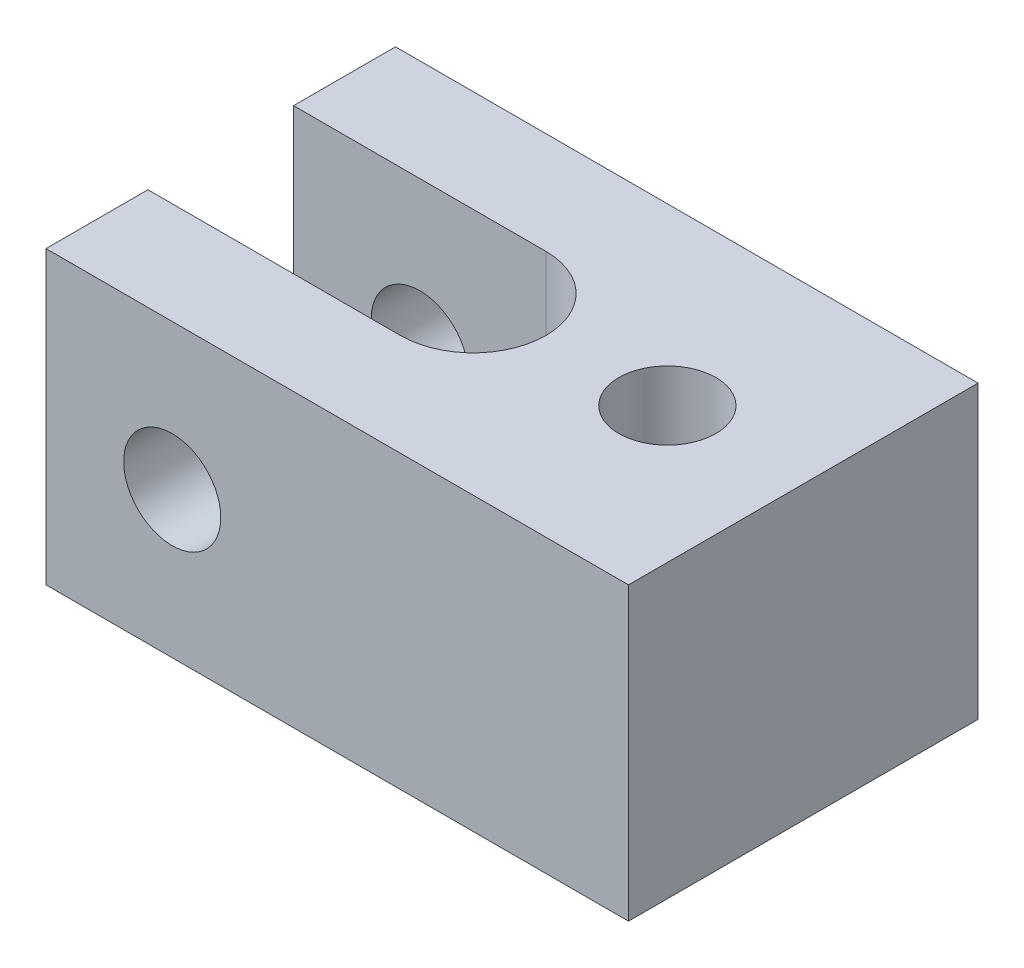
ISO-10303-21;
HEADER;
FILE_DESCRIPTION(('STEP AP214'),'2;1');
FILE_NAME('part.step','',(''),(''),'','','');
FILE_SCHEMA(('AUTOMOTIVE_DESIGN { 1 0 10303 214 1 1 1 1 }'));
ENDSEC;
DATA;
#1=APPLICATION_CONTEXT('core data for automotive mechanical design processes');
#2=APPLICATION_PROTOCOL_DEFINITION('international standard','automotive_design',2000,#1);
#3=PRODUCT_CONTEXT('',#1,'mechanical');
#4=PRODUCT('Part','Part','',(#3));
#5=PRODUCT_RELATED_PRODUCT_CATEGORY('part','',(#4));
#6=PRODUCT_DEFINITION_FORMATION('','',#4);
#7=PRODUCT_DEFINITION_CONTEXT('part definition',#1,'design');
#8=PRODUCT_DEFINITION('design','',#6,#7);
#9=PRODUCT_DEFINITION_SHAPE('','',#8);
#10=(LENGTH_UNIT() NAMED_UNIT(*) SI_UNIT(.MILLI.,.METRE.));
#11=(NAMED_UNIT(*) PLANE_ANGLE_UNIT() SI_UNIT($,.RADIAN.));
#12=(NAMED_UNIT(*) SI_UNIT($,.STERADIAN.) SOLID_ANGLE_UNIT());
#13=UNCERTAINTY_MEASURE_WITH_UNIT(LENGTH_MEASURE(1.E-05),#10,'distance_accuracy_value','');
#14=(GEOMETRIC_REPRESENTATION_CONTEXT(3) GLOBAL_UNCERTAINTY_ASSIGNED_CONTEXT((#13)) GLOBAL_UNIT_ASSIGNED_CONTEXT((#10,
#11,#12)) REPRESENTATION_CONTEXT('',''));
#15=CARTESIAN_POINT('',(0.,0.,0.));
#16=DIRECTION('',(0.,0.,1.));
#17=DIRECTION('',(1.,0.,0.));
#18=AXIS2_PLACEMENT_3D('',#15,#16,#17);
#19=CARTESIAN_POINT('',(0.,0.,22.86));
#20=DIRECTION('',(1.,0.,0.));
#21=DIRECTION('',(0.,0.,-1.));
#22=AXIS2_PLACEMENT_3D('',#19,#20,#21);
#23=PLANE('',#22);
#24=DIRECTION('',(0.,0.,-1.));
#25=VECTOR('',#24,1.);
#26=CARTESIAN_POINT('',(0.,19.05,22.86));
#27=LINE('',#26,#25);
#28=CARTESIAN_POINT('',(0.,19.05,22.86));
#29=VERTEX_POINT('',#28);
#30=CARTESIAN_POINT('',(0.,19.05,16.1925));
#31=VERTEX_POINT('',#30);
#32=EDGE_CURVE('E151',#29,#31,#27,.T.);
#33=ORIENTED_EDGE('',*,*,#32,.T.);
#34=DIRECTION('',(0.,-1.,0.));
#35=VECTOR('',#34,1.);
#36=CARTESIAN_POINT('',(0.,19.05,16.1925));
#37=LINE('',#36,#35);
#38=CARTESIAN_POINT('',(0.,0.,16.1925));
#39=VERTEX_POINT('',#38);
#40=EDGE_CURVE('E171',#31,#39,#37,.T.);
#41=ORIENTED_EDGE('',*,*,#40,.T.);
#42=DIRECTION('',(0.,0.,-1.));
#43=VECTOR('',#42,1.);
#44=CARTESIAN_POINT('',(0.,0.,22.86));
#45=LINE('',#44,#43);
#46=CARTESIAN_POINT('',(0.,0.,22.86));
#47=VERTEX_POINT('',#46);
#48=EDGE_CURVE('E11',#47,#39,#45,.T.);
#49=ORIENTED_EDGE('',*,*,#48,.F.);
#50=DIRECTION('',(0.,-1.,0.));
#51=VECTOR('',#50,1.);
#52=CARTESIAN_POINT('',(0.,0.,22.86));
#53=LINE('',#52,#51);
#54=EDGE_CURVE('E199',#29,#47,#53,.T.);
#55=ORIENTED_EDGE('',*,*,#54,.F.);
#56=EDGE_LOOP('',(#33,#41,#49,#55));
#57=FACE_BOUND('',#56,.T.);
#58=ADVANCED_FACE('F39',(#57),#23,.F.);
#59=CARTESIAN_POINT('',(8.255,9.525,22.86));
#60=DIRECTION('',(0.,0.,-1.));
#61=DIRECTION('',(-1.,0.,0.));
#62=AXIS2_PLACEMENT_3D('',#59,#60,#61);
#63=CYLINDRICAL_SURFACE('',#62,3.175);
#64=CARTESIAN_POINT('',(8.255,9.525,16.1925));
#65=DIRECTION('',(0.,0.,1.));
#66=DIRECTION('',(1.,0.,0.));
#67=AXIS2_PLACEMENT_3D('',#64,#65,#66);
#68=CIRCLE('',#67,3.175);
#69=CARTESIAN_POINT('',(11.43,9.525,16.1925));
#70=VERTEX_POINT('',#69);
#71=EDGE_CURVE('E43',#70,#70,#68,.T.);
#72=ORIENTED_EDGE('',*,*,#71,.F.);
#73=EDGE_LOOP('',(#72));
#74=FACE_BOUND('',#73,.T.);
#75=CARTESIAN_POINT('',(8.255,9.525,22.86));
#76=DIRECTION('',(0.,0.,1.));
#77=DIRECTION('',(1.,0.,0.));
#78=AXIS2_PLACEMENT_3D('',#75,#76,#77);
#79=CIRCLE('',#78,3.175);
#80=CARTESIAN_POINT('',(11.43,9.525,22.86));
#81=VERTEX_POINT('',#80);
#82=EDGE_CURVE('E192',#81,#81,#79,.T.);
#83=ORIENTED_EDGE('',*,*,#82,.T.);
#84=EDGE_LOOP('',(#83));
#85=FACE_BOUND('',#84,.T.);
#86=ADVANCED_FACE('F252',(#74,#85),#63,.F.);
#87=CARTESIAN_POINT('',(0.,0.,22.86));
#88=DIRECTION('',(0.,0.,-1.));
#89=DIRECTION('',(-1.,0.,0.));
#90=AXIS2_PLACEMENT_3D('',#87,#88,#89);
#91=PLANE('',#90);
#92=ORIENTED_EDGE('',*,*,#54,.T.);
#93=DIRECTION('',(1.,0.,0.));
#94=VECTOR('',#93,1.);
#95=CARTESIAN_POINT('',(0.,0.,22.86));
#96=LINE('',#95,#94);
#97=CARTESIAN_POINT('',(38.1,0.,22.86));
#98=VERTEX_POINT('',#97);
#99=EDGE_CURVE('E106',#47,#98,#96,.T.);
#100=ORIENTED_EDGE('',*,*,#99,.T.);
#101=DIRECTION('',(0.,1.,0.));
#102=VECTOR('',#101,1.);
#103=CARTESIAN_POINT('',(38.1,0.,22.86));
#104=LINE('',#103,#102);
#105=CARTESIAN_POINT('',(38.1,19.05,22.86));
#106=VERTEX_POINT('',#105);
#107=EDGE_CURVE('E158',#98,#106,#104,.T.);
#108=ORIENTED_EDGE('',*,*,#107,.T.);
#109=DIRECTION('',(-1.,0.,0.));
#110=VECTOR('',#109,1.);
#111=CARTESIAN_POINT('',(0.,19.05,22.86));
#112=LINE('',#111,#110);
#113=EDGE_CURVE('E72',#106,#29,#112,.T.);
#114=ORIENTED_EDGE('',*,*,#113,.T.);
#115=EDGE_LOOP('',(#92,#100,#108,#114));
#116=FACE_BOUND('',#115,.T.);
#117=ORIENTED_EDGE('',*,*,#82,.F.);
#118=EDGE_LOOP('',(#117));
#119=FACE_BOUND('',#118,.T.);
#120=ADVANCED_FACE('F236',(#116,#119),#91,.F.);
#121=CARTESIAN_POINT('',(0.,0.,0.));
#122=DIRECTION('',(0.,0.,-1.));
#123=DIRECTION('',(-1.,0.,0.));
#124=AXIS2_PLACEMENT_3D('',#121,#122,#123);
#125=PLANE('',#124);
#126=DIRECTION('',(0.,-1.,0.));
#127=VECTOR('',#126,1.);
#128=CARTESIAN_POINT('',(0.,0.,0.));
#129=LINE('',#128,#127);
#130=CARTESIAN_POINT('',(0.,19.05,0.));
#131=VERTEX_POINT('',#130);
#132=CARTESIAN_POINT('',(0.,0.,0.));
#133=VERTEX_POINT('',#132);
#134=EDGE_CURVE('E196',#131,#133,#129,.T.);
#135=ORIENTED_EDGE('',*,*,#134,.F.);
#136=DIRECTION('',(-1.,0.,0.));
#137=VECTOR('',#136,1.);
#138=CARTESIAN_POINT('',(0.,19.05,0.));
#139=LINE('',#138,#137);
#140=CARTESIAN_POINT('',(38.1,19.05,0.));
#141=VERTEX_POINT('',#140);
#142=EDGE_CURVE('E148',#141,#131,#139,.T.);
#143=ORIENTED_EDGE('',*,*,#142,.F.);
#144=DIRECTION('',(0.,1.,0.));
#145=VECTOR('',#144,1.);
#146=CARTESIAN_POINT('',(38.1,0.,0.));
#147=LINE('',#146,#145);
#148=CARTESIAN_POINT('',(38.1,0.,0.));
#149=VERTEX_POINT('',#148);
#150=EDGE_CURVE('E210',#149,#141,#147,.T.);
#151=ORIENTED_EDGE('',*,*,#150,.F.);
#152=DIRECTION('',(1.,0.,0.));
#153=VECTOR('',#152,1.);
#154=CARTESIAN_POINT('',(0.,0.,0.));
#155=LINE('',#154,#153);
#156=EDGE_CURVE('E208',#133,#149,#155,.T.);
#157=ORIENTED_EDGE('',*,*,#156,.F.);
#158=EDGE_LOOP('',(#135,#143,#151,#157));
#159=FACE_BOUND('',#158,.T.);
#160=CARTESIAN_POINT('',(8.255,9.525,0.));
#161=DIRECTION('',(0.,0.,1.));
#162=DIRECTION('',(1.,0.,0.));
#163=AXIS2_PLACEMENT_3D('',#160,#161,#162);
#164=CIRCLE('',#163,3.175);
#165=CARTESIAN_POINT('',(11.43,9.525,0.));
#166=VERTEX_POINT('',#165);
#167=EDGE_CURVE('E178',#166,#166,#164,.T.);
#168=ORIENTED_EDGE('',*,*,#167,.T.);
#169=EDGE_LOOP('',(#168));
#170=FACE_BOUND('',#169,.T.);
#171=ADVANCED_FACE('F242',(#159,#170),#125,.T.);
#172=CARTESIAN_POINT('',(0.,0.,6.6675));
#173=VERTEX_POINT('',#172);
#174=EDGE_CURVE('E49',#173,#133,#45,.T.);
#175=ORIENTED_EDGE('',*,*,#174,.F.);
#176=DIRECTION('',(0.,-1.,0.));
#177=VECTOR('',#176,1.);
#178=CARTESIAN_POINT('',(0.,19.05,6.6675));
#179=LINE('',#178,#177);
#180=CARTESIAN_POINT('',(0.,19.05,6.6675));
#181=VERTEX_POINT('',#180);
#182=EDGE_CURVE('E134',#181,#173,#179,.T.);
#183=ORIENTED_EDGE('',*,*,#182,.F.);
#184=EDGE_CURVE('E97',#181,#131,#27,.T.);
#185=ORIENTED_EDGE('',*,*,#184,.T.);
#186=ORIENTED_EDGE('',*,*,#134,.T.);
#187=EDGE_LOOP('',(#175,#183,#185,#186));
#188=FACE_BOUND('',#187,.T.);
#189=ADVANCED_FACE('F41',(#188),#23,.F.);
#190=CARTESIAN_POINT('',(0.,0.,22.86));
#191=DIRECTION('',(0.,1.,0.));
#192=DIRECTION('',(0.,0.,1.));
#193=AXIS2_PLACEMENT_3D('',#190,#191,#192);
#194=PLANE('',#193);
#195=CARTESIAN_POINT('',(29.21,0.,11.43));
#196=DIRECTION('',(0.,-1.,0.));
#197=DIRECTION('',(0.,0.,-1.));
#198=AXIS2_PLACEMENT_3D('',#195,#196,#197);
#199=CIRCLE('',#198,3.175);
#200=CARTESIAN_POINT('',(29.21,0.,8.255));
#201=VERTEX_POINT('',#200);
#202=EDGE_CURVE('E349',#201,#201,#199,.T.);
#203=ORIENTED_EDGE('',*,*,#202,.F.);
#204=EDGE_LOOP('',(#203));
#205=FACE_BOUND('',#204,.T.);
#206=ORIENTED_EDGE('',*,*,#48,.T.);
#207=DIRECTION('',(-1.,0.,0.));
#208=VECTOR('',#207,1.);
#209=CARTESIAN_POINT('',(0.,0.,16.1925));
#210=LINE('',#209,#208);
#211=CARTESIAN_POINT('',(16.51,0.,16.1925));
#212=VERTEX_POINT('',#211);
#213=EDGE_CURVE('E139',#212,#39,#210,.T.);
#214=ORIENTED_EDGE('',*,*,#213,.F.);
#215=CARTESIAN_POINT('',(16.51,0.,11.43));
#216=DIRECTION('',(0.,-1.,0.));
#217=DIRECTION('',(0.,0.,-1.));
#218=AXIS2_PLACEMENT_3D('',#215,#216,#217);
#219=CIRCLE('',#218,4.7625);
#220=CARTESIAN_POINT('',(16.51,0.,6.6675));
#221=VERTEX_POINT('',#220);
#222=EDGE_CURVE('E225',#221,#212,#219,.T.);
#223=ORIENTED_EDGE('',*,*,#222,.F.);
#224=DIRECTION('',(1.,0.,0.));
#225=VECTOR('',#224,1.);
#226=CARTESIAN_POINT('',(0.,0.,6.6675));
#227=LINE('',#226,#225);
#228=EDGE_CURVE('E223',#173,#221,#227,.T.);
#229=ORIENTED_EDGE('',*,*,#228,.F.);
#230=ORIENTED_EDGE('',*,*,#174,.T.);
#231=ORIENTED_EDGE('',*,*,#156,.T.);
#232=DIRECTION('',(0.,0.,-1.));
#233=VECTOR('',#232,1.);
#234=CARTESIAN_POINT('',(38.1,0.,22.86));
#235=LINE('',#234,#233);
#236=EDGE_CURVE('E165',#98,#149,#235,.T.);
#237=ORIENTED_EDGE('',*,*,#236,.F.);
#238=ORIENTED_EDGE('',*,*,#99,.F.);
#239=EDGE_LOOP('',(#206,#214,#223,#229,#230,#231,#237,#238));
#240=FACE_BOUND('',#239,.T.);
#241=ADVANCED_FACE('F234',(#205,#240),#194,.F.);
#242=CARTESIAN_POINT('',(38.1,0.,22.86));
#243=DIRECTION('',(-1.,0.,0.));
#244=DIRECTION('',(0.,0.,1.));
#245=AXIS2_PLACEMENT_3D('',#242,#243,#244);
#246=PLANE('',#245);
#247=ORIENTED_EDGE('',*,*,#150,.T.);
#248=DIRECTION('',(0.,0.,-1.));
#249=VECTOR('',#248,1.);
#250=CARTESIAN_POINT('',(38.1,19.05,22.86));
#251=LINE('',#250,#249);
#252=EDGE_CURVE('E156',#106,#141,#251,.T.);
#253=ORIENTED_EDGE('',*,*,#252,.F.);
#254=ORIENTED_EDGE('',*,*,#107,.F.);
#255=ORIENTED_EDGE('',*,*,#236,.T.);
#256=EDGE_LOOP('',(#247,#253,#254,#255));
#257=FACE_BOUND('',#256,.T.);
#258=ADVANCED_FACE('F240',(#257),#246,.F.);
#259=CARTESIAN_POINT('',(0.,19.05,22.86));
#260=DIRECTION('',(0.,-1.,0.));
#261=DIRECTION('',(0.,0.,-1.));
#262=AXIS2_PLACEMENT_3D('',#259,#260,#261);
#263=PLANE('',#262);
#264=CARTESIAN_POINT('',(29.21,19.05,11.43));
#265=DIRECTION('',(0.,-1.,0.));
#266=DIRECTION('',(0.,0.,-1.));
#267=AXIS2_PLACEMENT_3D('',#264,#265,#266);
#268=CIRCLE('',#267,3.175);
#269=CARTESIAN_POINT('',(29.21,19.05,8.255));
#270=VERTEX_POINT('',#269);
#271=EDGE_CURVE('E226',#270,#270,#268,.T.);
#272=ORIENTED_EDGE('',*,*,#271,.T.);
#273=EDGE_LOOP('',(#272));
#274=FACE_BOUND('',#273,.T.);
#275=CARTESIAN_POINT('',(16.51,19.05,11.43));
#276=DIRECTION('',(0.,-1.,0.));
#277=DIRECTION('',(0.,0.,-1.));
#278=AXIS2_PLACEMENT_3D('',#275,#276,#277);
#279=CIRCLE('',#278,4.7625);
#280=CARTESIAN_POINT('',(16.51,19.05,6.6675));
#281=VERTEX_POINT('',#280);
#282=CARTESIAN_POINT('',(16.51,19.05,16.1925));
#283=VERTEX_POINT('',#282);
#284=EDGE_CURVE('E60',#281,#283,#279,.T.);
#285=ORIENTED_EDGE('',*,*,#284,.T.);
#286=DIRECTION('',(-1.,0.,0.));
#287=VECTOR('',#286,1.);
#288=CARTESIAN_POINT('',(0.,19.05,16.1925));
#289=LINE('',#288,#287);
#290=EDGE_CURVE('E143',#283,#31,#289,.T.);
#291=ORIENTED_EDGE('',*,*,#290,.T.);
#292=ORIENTED_EDGE('',*,*,#32,.F.);
#293=ORIENTED_EDGE('',*,*,#113,.F.);
#294=ORIENTED_EDGE('',*,*,#252,.T.);
#295=ORIENTED_EDGE('',*,*,#142,.T.);
#296=ORIENTED_EDGE('',*,*,#184,.F.);
#297=DIRECTION('',(1.,0.,0.));
#298=VECTOR('',#297,1.);
#299=CARTESIAN_POINT('',(0.,19.05,6.6675));
#300=LINE('',#299,#298);
#301=EDGE_CURVE('E131',#181,#281,#300,.T.);
#302=ORIENTED_EDGE('',*,*,#301,.T.);
#303=EDGE_LOOP('',(#285,#291,#292,#293,#294,#295,#296,#302));
#304=FACE_BOUND('',#303,.T.);
#305=ADVANCED_FACE('F145',(#274,#304),#263,.F.);
#306=CARTESIAN_POINT('',(8.255,9.525,6.6675));
#307=DIRECTION('',(0.,0.,-1.));
#308=DIRECTION('',(-1.,0.,0.));
#309=AXIS2_PLACEMENT_3D('',#306,#307,#308);
#310=CIRCLE('',#309,3.175);
#311=CARTESIAN_POINT('',(5.08,9.525,6.6675));
#312=VERTEX_POINT('',#311);
#313=EDGE_CURVE('E168',#312,#312,#310,.T.);
#314=ORIENTED_EDGE('',*,*,#313,.F.);
#315=EDGE_LOOP('',(#314));
#316=FACE_BOUND('',#315,.T.);
#317=ORIENTED_EDGE('',*,*,#167,.F.);
#318=EDGE_LOOP('',(#317));
#319=FACE_BOUND('',#318,.T.);
#320=ADVANCED_FACE('F248',(#316,#319),#63,.F.);
#321=CARTESIAN_POINT('',(0.,19.05,16.1925));
#322=DIRECTION('',(0.,0.,1.));
#323=DIRECTION('',(1.,0.,0.));
#324=AXIS2_PLACEMENT_3D('',#321,#322,#323);
#325=PLANE('',#324);
#326=ORIENTED_EDGE('',*,*,#71,.T.);
#327=EDGE_LOOP('',(#326));
#328=FACE_BOUND('',#327,.T.);
#329=ORIENTED_EDGE('',*,*,#213,.T.);
#330=ORIENTED_EDGE('',*,*,#40,.F.);
#331=ORIENTED_EDGE('',*,*,#290,.F.);
#332=DIRECTION('',(0.,-1.,0.));
#333=VECTOR('',#332,1.);
#334=CARTESIAN_POINT('',(16.51,19.05,16.1925));
#335=LINE('',#334,#333);
#336=EDGE_CURVE('E181',#283,#212,#335,.T.);
#337=ORIENTED_EDGE('',*,*,#336,.T.);
#338=EDGE_LOOP('',(#329,#330,#331,#337));
#339=FACE_BOUND('',#338,.T.);
#340=ADVANCED_FACE('F233',(#328,#339),#325,.F.);
#341=CARTESIAN_POINT('',(16.51,19.05,11.43));
#342=DIRECTION('',(0.,-1.,0.));
#343=DIRECTION('',(0.,0.,-1.));
#344=AXIS2_PLACEMENT_3D('',#341,#342,#343);
#345=CYLINDRICAL_SURFACE('',#344,4.7625);
#346=ORIENTED_EDGE('',*,*,#222,.T.);
#347=ORIENTED_EDGE('',*,*,#336,.F.);
#348=ORIENTED_EDGE('',*,*,#284,.F.);
#349=DIRECTION('',(0.,-1.,0.));
#350=VECTOR('',#349,1.);
#351=CARTESIAN_POINT('',(16.51,19.05,6.6675));
#352=LINE('',#351,#350);
#353=EDGE_CURVE('E136',#281,#221,#352,.T.);
#354=ORIENTED_EDGE('',*,*,#353,.T.);
#355=EDGE_LOOP('',(#346,#347,#348,#354));
#356=FACE_BOUND('',#355,.T.);
#357=ADVANCED_FACE('F257',(#356),#345,.F.);
#358=CARTESIAN_POINT('',(0.,19.05,6.6675));
#359=DIRECTION('',(0.,0.,-1.));
#360=DIRECTION('',(-1.,0.,0.));
#361=AXIS2_PLACEMENT_3D('',#358,#359,#360);
#362=PLANE('',#361);
#363=ORIENTED_EDGE('',*,*,#313,.T.);
#364=EDGE_LOOP('',(#363));
#365=FACE_BOUND('',#364,.T.);
#366=ORIENTED_EDGE('',*,*,#228,.T.);
#367=ORIENTED_EDGE('',*,*,#353,.F.);
#368=ORIENTED_EDGE('',*,*,#301,.F.);
#369=ORIENTED_EDGE('',*,*,#182,.T.);
#370=EDGE_LOOP('',(#366,#367,#368,#369));
#371=FACE_BOUND('',#370,.T.);
#372=ADVANCED_FACE('F133',(#365,#371),#362,.F.);
#373=CARTESIAN_POINT('',(29.21,19.05,11.43));
#374=DIRECTION('',(0.,-1.,0.));
#375=DIRECTION('',(0.,0.,-1.));
#376=AXIS2_PLACEMENT_3D('',#373,#374,#375);
#377=CYLINDRICAL_SURFACE('',#376,3.175);
#378=CARTESIAN_POINT('',(29.21,19.05,8.255));
#379=CARTESIAN_POINT('',(29.21,18.8515625,8.255));
#380=CARTESIAN_POINT('',(29.21,18.653125,8.255));
#381=CARTESIAN_POINT('',(29.21,18.25625,8.255));
#382=CARTESIAN_POINT('',(29.21,18.0578125,8.255));
#383=CARTESIAN_POINT('',(29.21,17.6609375,8.255));
#384=CARTESIAN_POINT('',(29.21,17.4625,8.255));
#385=CARTESIAN_POINT('',(29.21,17.065625,8.255));
#386=CARTESIAN_POINT('',(29.21,16.8671875,8.255));
#387=CARTESIAN_POINT('',(29.21,16.4703125,8.255));
#388=CARTESIAN_POINT('',(29.21,16.271875,8.255));
#389=CARTESIAN_POINT('',(29.21,15.875,8.255));
#390=CARTESIAN_POINT('',(29.21,15.6765625,8.255));
#391=CARTESIAN_POINT('',(29.21,15.2796875,8.255));
#392=CARTESIAN_POINT('',(29.21,15.08125,8.255));
#393=CARTESIAN_POINT('',(29.21,14.684375,8.255));
#394=CARTESIAN_POINT('',(29.21,14.4859375,8.255));
#395=CARTESIAN_POINT('',(29.21,14.0890625,8.255));
#396=CARTESIAN_POINT('',(29.21,13.890625,8.255));
#397=CARTESIAN_POINT('',(29.21,13.49375,8.255));
#398=CARTESIAN_POINT('',(29.21,13.2953125,8.255));
#399=CARTESIAN_POINT('',(29.21,12.8984375,8.255));
#400=CARTESIAN_POINT('',(29.21,12.7,8.255));
#401=CARTESIAN_POINT('',(29.21,12.303125,8.255));
#402=CARTESIAN_POINT('',(29.21,12.1046875,8.255));
#403=CARTESIAN_POINT('',(29.21,11.7078125,8.255));
#404=CARTESIAN_POINT('',(29.21,11.509375,8.255));
#405=CARTESIAN_POINT('',(29.21,11.1125,8.255));
#406=CARTESIAN_POINT('',(29.21,10.9140625,8.255));
#407=CARTESIAN_POINT('',(29.21,10.5171875,8.255));
#408=CARTESIAN_POINT('',(29.21,10.31875,8.255));
#409=CARTESIAN_POINT('',(29.21,9.921875,8.255));
#410=CARTESIAN_POINT('',(29.21,9.7234375,8.255));
#411=CARTESIAN_POINT('',(29.21,9.3265625,8.255));
#412=CARTESIAN_POINT('',(29.21,9.128125,8.255));
#413=CARTESIAN_POINT('',(29.21,8.73125,8.255));
#414=CARTESIAN_POINT('',(29.21,8.5328125,8.255));
#415=CARTESIAN_POINT('',(29.21,8.1359375,8.255));
#416=CARTESIAN_POINT('',(29.21,7.9375,8.255));
#417=CARTESIAN_POINT('',(29.21,7.540625,8.255));
#418=CARTESIAN_POINT('',(29.21,7.3421875,8.255));
#419=CARTESIAN_POINT('',(29.21,6.9453125,8.255));
#420=CARTESIAN_POINT('',(29.21,6.746875,8.255));
#421=CARTESIAN_POINT('',(29.21,6.35,8.255));
#422=CARTESIAN_POINT('',(29.21,6.1515625,8.255));
#423=CARTESIAN_POINT('',(29.21,5.7546875,8.255));
#424=CARTESIAN_POINT('',(29.21,5.55625,8.255));
#425=CARTESIAN_POINT('',(29.21,5.159375,8.255));
#426=CARTESIAN_POINT('',(29.21,4.9609375,8.255));
#427=CARTESIAN_POINT('',(29.21,4.5640625,8.255));
#428=CARTESIAN_POINT('',(29.21,4.365625,8.255));
#429=CARTESIAN_POINT('',(29.21,3.96875,8.255));
#430=CARTESIAN_POINT('',(29.21,3.7703125,8.255));
#431=CARTESIAN_POINT('',(29.21,3.3734375,8.255));
#432=CARTESIAN_POINT('',(29.21,3.175,8.255));
#433=CARTESIAN_POINT('',(29.21,2.778125,8.255));
#434=CARTESIAN_POINT('',(29.21,2.5796875,8.255));
#435=CARTESIAN_POINT('',(29.21,2.1828125,8.255));
#436=CARTESIAN_POINT('',(29.21,1.984375,8.255));
#437=CARTESIAN_POINT('',(29.21,1.5875,8.255));
#438=CARTESIAN_POINT('',(29.21,1.3890625,8.255));
#439=CARTESIAN_POINT('',(29.21,0.992187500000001,8.255));
#440=CARTESIAN_POINT('',(29.21,0.793750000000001,8.255));
#441=CARTESIAN_POINT('',(29.21,0.396875,8.255));
#442=CARTESIAN_POINT('',(29.21,0.1984375,8.255));
#443=CARTESIAN_POINT('',(29.21,0.,8.255));
#444=B_SPLINE_CURVE_WITH_KNOTS('',3,(#378,#379,#380,#381,#382,#383,#384,#385,#386,#387,#388,
#389,#390,#391,#392,#393,#394,#395,#396,#397,#398,#399,#400,#401,#402,#403,#404,#405,#406,#407,
#408,#409,#410,#411,#412,#413,#414,#415,#416,#417,#418,#419,#420,#421,#422,#423,#424,#425,#426,
#427,#428,#429,#430,#431,#432,#433,#434,#435,#436,#437,#438,#439,#440,#441,#442,#443),
.UNSPECIFIED.,.F.,.F.,(4,2,2,2,2,2,2,2,2,2,2,2,2,2,2,2,2,2,2,2,2,2,2,2,2,2,2,2,2,2,2,2,4),(0.,
0.5953125,1.190625,1.7859375,2.38125,2.9765625,3.571875,4.1671875,4.7625,5.3578125,5.953125,
6.5484375,7.14375,7.7390625,8.334375,8.9296875,9.525,10.1203125,10.715625,11.3109375,11.90625,
12.5015625,13.096875,13.6921875,14.2875,14.8828125,15.478125,16.0734375,16.66875,17.2640625,
17.859375,18.4546875,19.05),.UNSPECIFIED.);
#445=EDGE_CURVE('BSEAM293',#270,#201,#444,.T.);
#446=ORIENTED_EDGE('',*,*,#271,.F.);
#447=ORIENTED_EDGE('',*,*,#202,.T.);
#448=ORIENTED_EDGE('',*,*,#445,.T.);
#449=ORIENTED_EDGE('',*,*,#445,.F.);
#450=EDGE_LOOP('',(#446,#448,#447,#449));
#451=FACE_BOUND('',#450,.T.);
#452=ADVANCED_FACE('F293',(#451),#377,.F.);
#453=CLOSED_SHELL('',(#58,#86,#120,#171,#189,#241,#258,#305,#320,#340,#357,#372,#452));
#454=MANIFOLD_SOLID_BREP('B2',#453);
#455=ADVANCED_BREP_SHAPE_REPRESENTATION('',(#18,#454),#14);
#456=SHAPE_DEFINITION_REPRESENTATION(#9,#455);
ENDSEC;
END-ISO-10303-21;
